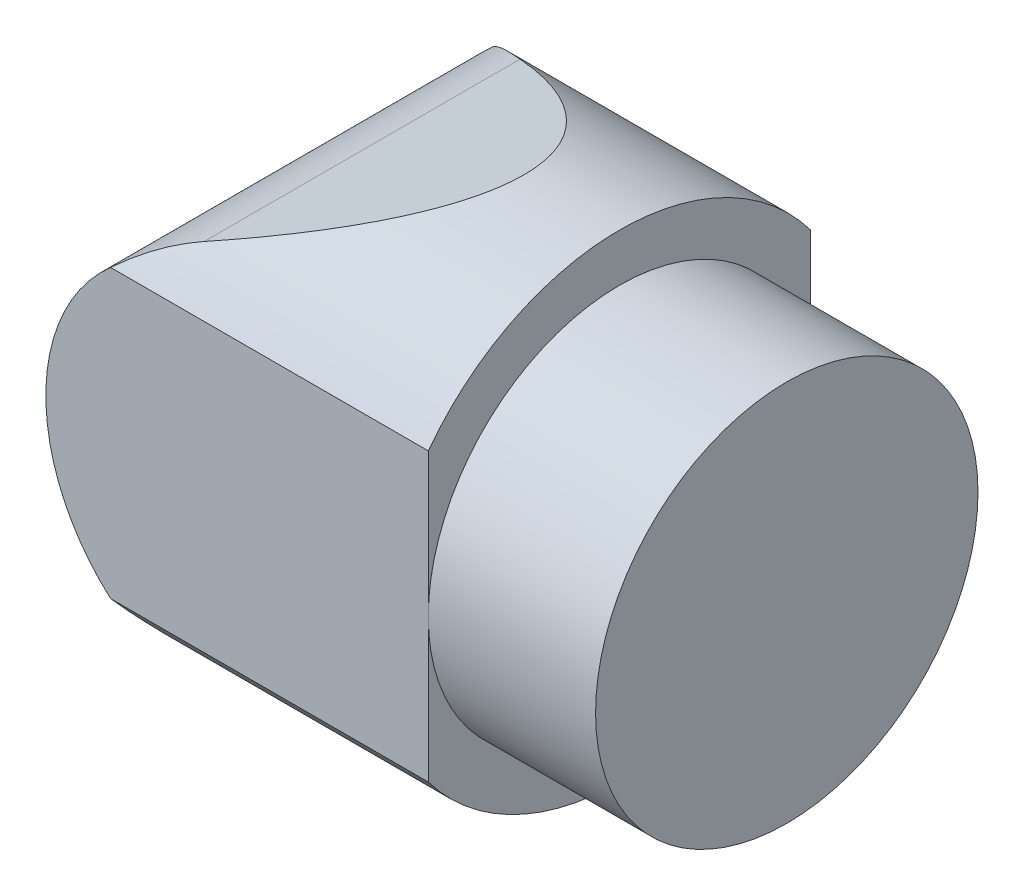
from build123d import *

# Parameters (mm, degrees)
SKETCH_1_R          = 50
EXTRUDE_1_DEPTH     = 100
SKETCH_1_3_R        = 40
EXTRUDE_2_DEPTH     = 35
CUT_EXTRUDE_1_DEPTH = 50
SKETCH_3_W          = 19.615049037
SKETCH_3_H          = 60
SKETCH_3_W_2        = 19.748202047
CUT_EXTRUDE_2_DEPTH = 107.770782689


with BuildPart() as part:
    # Sketch 1 → Extrude 1 (new body)
    with BuildSketch(Plane(origin=(0, 0, 0), x_dir=(0, 0, -1), z_dir=(1, 0, 0))):
        Circle(SKETCH_1_R)
    extrude(amount=-EXTRUDE_1_DEPTH)

    # Sketch 1_3 → Extrude 2 (add)
    with BuildSketch(Plane(origin=(0, 0, 0), x_dir=(0, 0, -1), z_dir=(1, 0, 0))):
        Circle(SKETCH_1_3_R)
    extrude(amount=EXTRUDE_2_DEPTH)

    # Sketch 2 → Cut-Extrude 1 (cut, symmetric)
    with BuildSketch(Plane.XY):
        with BuildLine():
            Line((-20, 50), (-53.831388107, 37.532555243))
            ThreePointArc((-53.831388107, 37.532555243), (-80, 0), (-53.831388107, -37.532555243))
            Line((-53.831388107, -37.532555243), (-20, -50))
            Line((-20, -50), (-100, -50))
            Line((-100, -50), (-100, 50))
            Line((-100, 50), (-20, 50))
        make_face()
    extrude(amount=CUT_EXTRUDE_1_DEPTH, both=True, mode=Mode.SUBTRACT)

    # Sketch 3 → Cut-Extrude 2 (cut, through all)
    with BuildSketch(Plane(origin=(0, 0, 0), x_dir=(0, 0, -1), z_dir=(1, 0, 0))):
        with Locations((-49.807524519, 0)):
            Rectangle(SKETCH_3_W, SKETCH_3_H)
        with Locations((49.874101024, 0)):
            Rectangle(SKETCH_3_W_2, SKETCH_3_H)
    extrude(amount=-CUT_EXTRUDE_2_DEPTH, mode=Mode.SUBTRACT)


solid = part.part
